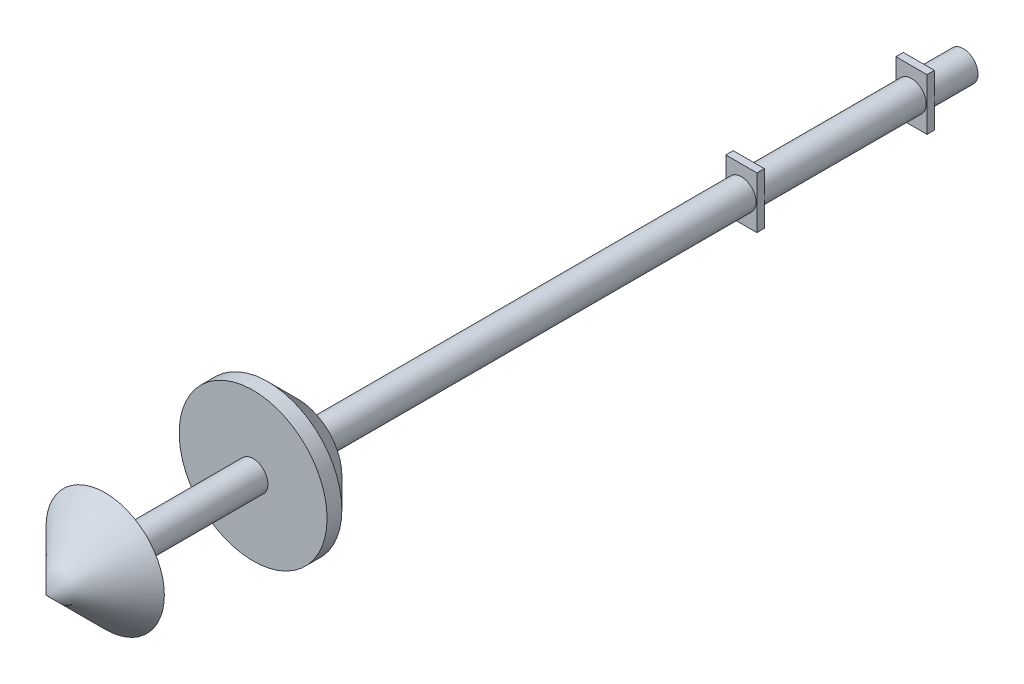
ISO-10303-21;
HEADER;
FILE_DESCRIPTION(('STEP AP214'),'2;1');
FILE_NAME('part.step','',(''),(''),'','','');
FILE_SCHEMA(('AUTOMOTIVE_DESIGN { 1 0 10303 214 1 1 1 1 }'));
ENDSEC;
DATA;
#1=APPLICATION_CONTEXT('core data for automotive mechanical design processes');
#2=APPLICATION_PROTOCOL_DEFINITION('international standard','automotive_design',2000,#1);
#3=PRODUCT_CONTEXT('',#1,'mechanical');
#4=PRODUCT('Part','Part','',(#3));
#5=PRODUCT_RELATED_PRODUCT_CATEGORY('part','',(#4));
#6=PRODUCT_DEFINITION_FORMATION('','',#4);
#7=PRODUCT_DEFINITION_CONTEXT('part definition',#1,'design');
#8=PRODUCT_DEFINITION('design','',#6,#7);
#9=PRODUCT_DEFINITION_SHAPE('','',#8);
#10=(LENGTH_UNIT() NAMED_UNIT(*) SI_UNIT(.MILLI.,.METRE.));
#11=(NAMED_UNIT(*) PLANE_ANGLE_UNIT() SI_UNIT($,.RADIAN.));
#12=(NAMED_UNIT(*) SI_UNIT($,.STERADIAN.) SOLID_ANGLE_UNIT());
#13=UNCERTAINTY_MEASURE_WITH_UNIT(LENGTH_MEASURE(1.E-05),#10,'distance_accuracy_value','');
#14=(GEOMETRIC_REPRESENTATION_CONTEXT(3) GLOBAL_UNCERTAINTY_ASSIGNED_CONTEXT((#13)) GLOBAL_UNIT_ASSIGNED_CONTEXT((#10,
#11,#12)) REPRESENTATION_CONTEXT('',''));
#15=CARTESIAN_POINT('',(0.,0.,0.));
#16=DIRECTION('',(0.,0.,1.));
#17=DIRECTION('',(1.,0.,0.));
#18=AXIS2_PLACEMENT_3D('',#15,#16,#17);
#19=CARTESIAN_POINT('',(0.,0.,330.));
#20=DIRECTION('',(0.,0.,1.));
#21=DIRECTION('',(1.,0.,0.));
#22=AXIS2_PLACEMENT_3D('',#19,#20,#21);
#23=PLANE('',#22);
#24=CARTESIAN_POINT('',(0.,0.,330.));
#25=DIRECTION('',(0.,0.,1.));
#26=DIRECTION('',(1.,0.,0.));
#27=AXIS2_PLACEMENT_3D('',#24,#25,#26);
#28=CIRCLE('',#27,50.);
#29=CARTESIAN_POINT('',(50.,0.,330.));
#30=VERTEX_POINT('',#29);
#31=EDGE_CURVE('E115',#30,#30,#28,.T.);
#32=ORIENTED_EDGE('',*,*,#31,.T.);
#33=EDGE_LOOP('',(#32));
#34=FACE_BOUND('',#33,.T.);
#35=CARTESIAN_POINT('',(0.,0.,330.));
#36=DIRECTION('',(0.,0.,1.));
#37=DIRECTION('',(1.,0.,0.));
#38=AXIS2_PLACEMENT_3D('',#35,#36,#37);
#39=CIRCLE('',#38,10.);
#40=CARTESIAN_POINT('',(10.,0.,330.));
#41=VERTEX_POINT('',#40);
#42=EDGE_CURVE('E107',#41,#41,#39,.T.);
#43=ORIENTED_EDGE('',*,*,#42,.F.);
#44=EDGE_LOOP('',(#43));
#45=FACE_BOUND('',#44,.T.);
#46=ADVANCED_FACE('F32',(#34,#45),#23,.T.);
#47=CARTESIAN_POINT('',(10.5,17.5,-120.));
#48=DIRECTION('',(0.,0.,-1.));
#49=DIRECTION('',(-1.,0.,0.));
#50=AXIS2_PLACEMENT_3D('',#47,#48,#49);
#51=PLANE('',#50);
#52=DIRECTION('',(1.,0.,0.));
#53=VECTOR('',#52,1.);
#54=CARTESIAN_POINT('',(-10.5,17.5,-120.));
#55=LINE('',#54,#53);
#56=CARTESIAN_POINT('',(-10.5,17.5,-120.));
#57=VERTEX_POINT('',#56);
#58=CARTESIAN_POINT('',(10.5,17.5,-120.));
#59=VERTEX_POINT('',#58);
#60=EDGE_CURVE('E133',#57,#59,#55,.T.);
#61=ORIENTED_EDGE('',*,*,#60,.T.);
#62=DIRECTION('',(0.,-1.,0.));
#63=VECTOR('',#62,1.);
#64=CARTESIAN_POINT('',(10.5,17.5,-120.));
#65=LINE('',#64,#63);
#66=CARTESIAN_POINT('',(10.5,-17.5,-120.));
#67=VERTEX_POINT('',#66);
#68=EDGE_CURVE('E136',#59,#67,#65,.T.);
#69=ORIENTED_EDGE('',*,*,#68,.T.);
#70=DIRECTION('',(-1.,0.,0.));
#71=VECTOR('',#70,1.);
#72=CARTESIAN_POINT('',(10.5,-17.5,-120.));
#73=LINE('',#72,#71);
#74=CARTESIAN_POINT('',(-10.5,-17.5,-120.));
#75=VERTEX_POINT('',#74);
#76=EDGE_CURVE('E138',#67,#75,#73,.T.);
#77=ORIENTED_EDGE('',*,*,#76,.T.);
#78=DIRECTION('',(0.,1.,0.));
#79=VECTOR('',#78,1.);
#80=CARTESIAN_POINT('',(-10.5,-17.5,-120.));
#81=LINE('',#80,#79);
#82=EDGE_CURVE('E140',#75,#57,#81,.T.);
#83=ORIENTED_EDGE('',*,*,#82,.T.);
#84=EDGE_LOOP('',(#61,#69,#77,#83));
#85=FACE_BOUND('',#84,.T.);
#86=CARTESIAN_POINT('',(0.,0.,-120.));
#87=DIRECTION('',(0.,0.,-1.));
#88=DIRECTION('',(-1.,0.,0.));
#89=AXIS2_PLACEMENT_3D('',#86,#87,#88);
#90=CIRCLE('',#89,10.);
#91=CARTESIAN_POINT('',(-10.,0.,-120.));
#92=VERTEX_POINT('',#91);
#93=EDGE_CURVE('E118',#92,#92,#90,.T.);
#94=ORIENTED_EDGE('',*,*,#93,.F.);
#95=EDGE_LOOP('',(#94));
#96=FACE_BOUND('',#95,.T.);
#97=ADVANCED_FACE('F214',(#85,#96),#51,.T.);
#98=CARTESIAN_POINT('',(10.5,-17.5,-5.));
#99=DIRECTION('',(0.,0.,-1.));
#100=DIRECTION('',(-1.,0.,0.));
#101=AXIS2_PLACEMENT_3D('',#98,#99,#100);
#102=PLANE('',#101);
#103=DIRECTION('',(0.,-1.,0.));
#104=VECTOR('',#103,1.);
#105=CARTESIAN_POINT('',(10.5,17.5,-5.));
#106=LINE('',#105,#104);
#107=CARTESIAN_POINT('',(10.5,17.5,-5.));
#108=VERTEX_POINT('',#107);
#109=CARTESIAN_POINT('',(10.5,-17.5,-5.));
#110=VERTEX_POINT('',#109);
#111=EDGE_CURVE('E169',#108,#110,#106,.T.);
#112=ORIENTED_EDGE('',*,*,#111,.T.);
#113=DIRECTION('',(-1.,0.,0.));
#114=VECTOR('',#113,1.);
#115=CARTESIAN_POINT('',(10.5,-17.5,-5.));
#116=LINE('',#115,#114);
#117=CARTESIAN_POINT('',(-10.5,-17.5,-5.));
#118=VERTEX_POINT('',#117);
#119=EDGE_CURVE('E171',#110,#118,#116,.T.);
#120=ORIENTED_EDGE('',*,*,#119,.T.);
#121=DIRECTION('',(0.,1.,0.));
#122=VECTOR('',#121,1.);
#123=CARTESIAN_POINT('',(-10.5,17.5,-5.));
#124=LINE('',#123,#122);
#125=CARTESIAN_POINT('',(-10.5,17.5,-5.));
#126=VERTEX_POINT('',#125);
#127=EDGE_CURVE('E52',#118,#126,#124,.T.);
#128=ORIENTED_EDGE('',*,*,#127,.T.);
#129=DIRECTION('',(1.,0.,0.));
#130=VECTOR('',#129,1.);
#131=CARTESIAN_POINT('',(10.5,17.5,-5.));
#132=LINE('',#131,#130);
#133=EDGE_CURVE('E47',#126,#108,#132,.T.);
#134=ORIENTED_EDGE('',*,*,#133,.T.);
#135=EDGE_LOOP('',(#112,#120,#128,#134));
#136=FACE_BOUND('',#135,.T.);
#137=CARTESIAN_POINT('',(0.,0.,-5.));
#138=DIRECTION('',(0.,0.,-1.));
#139=DIRECTION('',(-1.,0.,0.));
#140=AXIS2_PLACEMENT_3D('',#137,#138,#139);
#141=CIRCLE('',#140,10.);
#142=CARTESIAN_POINT('',(-10.,0.,-5.));
#143=VERTEX_POINT('',#142);
#144=EDGE_CURVE('E154',#143,#143,#141,.T.);
#145=ORIENTED_EDGE('',*,*,#144,.F.);
#146=EDGE_LOOP('',(#145));
#147=FACE_BOUND('',#146,.T.);
#148=ADVANCED_FACE('F220',(#136,#147),#102,.T.);
#149=CARTESIAN_POINT('',(0.,0.,300.));
#150=DIRECTION('',(0.,0.,-1.));
#151=DIRECTION('',(-1.,0.,0.));
#152=AXIS2_PLACEMENT_3D('',#149,#150,#151);
#153=CYLINDRICAL_SURFACE('',#152,10.);
#154=CARTESIAN_POINT('',(0.,0.,300.));
#155=DIRECTION('',(0.,0.,1.));
#156=DIRECTION('',(1.,0.,0.));
#157=AXIS2_PLACEMENT_3D('',#154,#155,#156);
#158=CIRCLE('',#157,10.);
#159=CARTESIAN_POINT('',(10.,0.,300.));
#160=VERTEX_POINT('',#159);
#161=EDGE_CURVE('E190',#160,#160,#158,.T.);
#162=ORIENTED_EDGE('',*,*,#161,.F.);
#163=EDGE_LOOP('',(#162));
#164=FACE_BOUND('',#163,.T.);
#165=CARTESIAN_POINT('',(0.,0.,0.));
#166=DIRECTION('',(0.,0.,-1.));
#167=DIRECTION('',(-1.,0.,0.));
#168=AXIS2_PLACEMENT_3D('',#165,#166,#167);
#169=CIRCLE('',#168,10.);
#170=CARTESIAN_POINT('',(-10.,0.,0.));
#171=VERTEX_POINT('',#170);
#172=EDGE_CURVE('E187',#171,#171,#169,.T.);
#173=ORIENTED_EDGE('',*,*,#172,.F.);
#174=EDGE_LOOP('',(#173));
#175=FACE_BOUND('',#174,.T.);
#176=ADVANCED_FACE('F34',(#164,#175),#153,.T.);
#177=CARTESIAN_POINT('',(10.5,-17.5,0.));
#178=DIRECTION('',(0.,0.,-1.));
#179=DIRECTION('',(-1.,0.,0.));
#180=AXIS2_PLACEMENT_3D('',#177,#178,#179);
#181=PLANE('',#180);
#182=DIRECTION('',(0.,-1.,0.));
#183=VECTOR('',#182,1.);
#184=CARTESIAN_POINT('',(10.5,17.5,0.));
#185=LINE('',#184,#183);
#186=CARTESIAN_POINT('',(10.5,17.5,0.));
#187=VERTEX_POINT('',#186);
#188=CARTESIAN_POINT('',(10.5,-17.5,0.));
#189=VERTEX_POINT('',#188);
#190=EDGE_CURVE('E160',#187,#189,#185,.T.);
#191=ORIENTED_EDGE('',*,*,#190,.F.);
#192=DIRECTION('',(1.,0.,0.));
#193=VECTOR('',#192,1.);
#194=CARTESIAN_POINT('',(10.5,17.5,0.));
#195=LINE('',#194,#193);
#196=CARTESIAN_POINT('',(-10.5,17.5,0.));
#197=VERTEX_POINT('',#196);
#198=EDGE_CURVE('E167',#197,#187,#195,.T.);
#199=ORIENTED_EDGE('',*,*,#198,.F.);
#200=DIRECTION('',(0.,1.,0.));
#201=VECTOR('',#200,1.);
#202=CARTESIAN_POINT('',(-10.5,17.5,0.));
#203=LINE('',#202,#201);
#204=CARTESIAN_POINT('',(-10.5,-17.5,0.));
#205=VERTEX_POINT('',#204);
#206=EDGE_CURVE('E165',#205,#197,#203,.T.);
#207=ORIENTED_EDGE('',*,*,#206,.F.);
#208=DIRECTION('',(-1.,0.,0.));
#209=VECTOR('',#208,1.);
#210=CARTESIAN_POINT('',(10.5,-17.5,0.));
#211=LINE('',#210,#209);
#212=EDGE_CURVE('E163',#189,#205,#211,.T.);
#213=ORIENTED_EDGE('',*,*,#212,.F.);
#214=EDGE_LOOP('',(#191,#199,#207,#213));
#215=FACE_BOUND('',#214,.T.);
#216=ORIENTED_EDGE('',*,*,#172,.T.);
#217=EDGE_LOOP('',(#216));
#218=FACE_BOUND('',#217,.T.);
#219=ADVANCED_FACE('F258',(#215,#218),#181,.F.);
#220=CARTESIAN_POINT('',(10.5,17.5,-5.));
#221=DIRECTION('',(-1.,0.,0.));
#222=DIRECTION('',(0.,-1.,0.));
#223=AXIS2_PLACEMENT_3D('',#220,#221,#222);
#224=PLANE('',#223);
#225=ORIENTED_EDGE('',*,*,#190,.T.);
#226=DIRECTION('',(0.,0.,1.));
#227=VECTOR('',#226,1.);
#228=CARTESIAN_POINT('',(10.5,-17.5,-5.));
#229=LINE('',#228,#227);
#230=EDGE_CURVE('E184',#110,#189,#229,.T.);
#231=ORIENTED_EDGE('',*,*,#230,.F.);
#232=ORIENTED_EDGE('',*,*,#111,.F.);
#233=DIRECTION('',(0.,0.,1.));
#234=VECTOR('',#233,1.);
#235=CARTESIAN_POINT('',(10.5,17.5,-5.));
#236=LINE('',#235,#234);
#237=EDGE_CURVE('E175',#108,#187,#236,.T.);
#238=ORIENTED_EDGE('',*,*,#237,.T.);
#239=EDGE_LOOP('',(#225,#231,#232,#238));
#240=FACE_BOUND('',#239,.T.);
#241=ADVANCED_FACE('F261',(#240),#224,.F.);
#242=CARTESIAN_POINT('',(10.5,-17.5,-5.));
#243=DIRECTION('',(0.,1.,0.));
#244=DIRECTION('',(-1.,0.,0.));
#245=AXIS2_PLACEMENT_3D('',#242,#243,#244);
#246=PLANE('',#245);
#247=ORIENTED_EDGE('',*,*,#212,.T.);
#248=DIRECTION('',(0.,0.,1.));
#249=VECTOR('',#248,1.);
#250=CARTESIAN_POINT('',(-10.5,-17.5,-5.));
#251=LINE('',#250,#249);
#252=EDGE_CURVE('E181',#118,#205,#251,.T.);
#253=ORIENTED_EDGE('',*,*,#252,.F.);
#254=ORIENTED_EDGE('',*,*,#119,.F.);
#255=ORIENTED_EDGE('',*,*,#230,.T.);
#256=EDGE_LOOP('',(#247,#253,#254,#255));
#257=FACE_BOUND('',#256,.T.);
#258=ADVANCED_FACE('F271',(#257),#246,.F.);
#259=CARTESIAN_POINT('',(-10.5,17.5,-5.));
#260=DIRECTION('',(1.,0.,0.));
#261=DIRECTION('',(0.,1.,0.));
#262=AXIS2_PLACEMENT_3D('',#259,#260,#261);
#263=PLANE('',#262);
#264=ORIENTED_EDGE('',*,*,#206,.T.);
#265=DIRECTION('',(0.,0.,1.));
#266=VECTOR('',#265,1.);
#267=CARTESIAN_POINT('',(-10.5,17.5,-5.));
#268=LINE('',#267,#266);
#269=EDGE_CURVE('E178',#126,#197,#268,.T.);
#270=ORIENTED_EDGE('',*,*,#269,.F.);
#271=ORIENTED_EDGE('',*,*,#127,.F.);
#272=ORIENTED_EDGE('',*,*,#252,.T.);
#273=EDGE_LOOP('',(#264,#270,#271,#272));
#274=FACE_BOUND('',#273,.T.);
#275=ADVANCED_FACE('F267',(#274),#263,.F.);
#276=CARTESIAN_POINT('',(10.5,17.5,-5.));
#277=DIRECTION('',(0.,-1.,0.));
#278=DIRECTION('',(1.,0.,0.));
#279=AXIS2_PLACEMENT_3D('',#276,#277,#278);
#280=PLANE('',#279);
#281=ORIENTED_EDGE('',*,*,#198,.T.);
#282=ORIENTED_EDGE('',*,*,#237,.F.);
#283=ORIENTED_EDGE('',*,*,#133,.F.);
#284=ORIENTED_EDGE('',*,*,#269,.T.);
#285=EDGE_LOOP('',(#281,#282,#283,#284));
#286=FACE_BOUND('',#285,.T.);
#287=ADVANCED_FACE('F256',(#286),#280,.F.);
#288=CARTESIAN_POINT('',(0.,0.,-115.));
#289=DIRECTION('',(0.,0.,1.));
#290=DIRECTION('',(1.,0.,0.));
#291=AXIS2_PLACEMENT_3D('',#288,#289,#290);
#292=CYLINDRICAL_SURFACE('',#291,10.);
#293=CARTESIAN_POINT('',(0.,0.,-115.));
#294=DIRECTION('',(0.,0.,-1.));
#295=DIRECTION('',(-1.,0.,0.));
#296=AXIS2_PLACEMENT_3D('',#293,#294,#295);
#297=CIRCLE('',#296,10.);
#298=CARTESIAN_POINT('',(-10.,0.,-115.));
#299=VERTEX_POINT('',#298);
#300=EDGE_CURVE('E157',#299,#299,#297,.T.);
#301=ORIENTED_EDGE('',*,*,#300,.F.);
#302=EDGE_LOOP('',(#301));
#303=FACE_BOUND('',#302,.T.);
#304=ORIENTED_EDGE('',*,*,#144,.T.);
#305=EDGE_LOOP('',(#304));
#306=FACE_BOUND('',#305,.T.);
#307=ADVANCED_FACE('F237',(#303,#306),#292,.T.);
#308=CARTESIAN_POINT('',(10.5,17.5,-115.));
#309=DIRECTION('',(0.,0.,-1.));
#310=DIRECTION('',(-1.,0.,0.));
#311=AXIS2_PLACEMENT_3D('',#308,#309,#310);
#312=PLANE('',#311);
#313=DIRECTION('',(1.,0.,0.));
#314=VECTOR('',#313,1.);
#315=CARTESIAN_POINT('',(-10.5,17.5,-115.));
#316=LINE('',#315,#314);
#317=CARTESIAN_POINT('',(-10.5,17.5,-115.));
#318=VERTEX_POINT('',#317);
#319=CARTESIAN_POINT('',(10.5,17.5,-115.));
#320=VERTEX_POINT('',#319);
#321=EDGE_CURVE('E124',#318,#320,#316,.T.);
#322=ORIENTED_EDGE('',*,*,#321,.F.);
#323=DIRECTION('',(0.,1.,0.));
#324=VECTOR('',#323,1.);
#325=CARTESIAN_POINT('',(-10.5,-17.5,-115.));
#326=LINE('',#325,#324);
#327=CARTESIAN_POINT('',(-10.5,-17.5,-115.));
#328=VERTEX_POINT('',#327);
#329=EDGE_CURVE('E131',#328,#318,#326,.T.);
#330=ORIENTED_EDGE('',*,*,#329,.F.);
#331=DIRECTION('',(-1.,0.,0.));
#332=VECTOR('',#331,1.);
#333=CARTESIAN_POINT('',(10.5,-17.5,-115.));
#334=LINE('',#333,#332);
#335=CARTESIAN_POINT('',(10.5,-17.5,-115.));
#336=VERTEX_POINT('',#335);
#337=EDGE_CURVE('E129',#336,#328,#334,.T.);
#338=ORIENTED_EDGE('',*,*,#337,.F.);
#339=DIRECTION('',(0.,-1.,0.));
#340=VECTOR('',#339,1.);
#341=CARTESIAN_POINT('',(10.5,17.5,-115.));
#342=LINE('',#341,#340);
#343=EDGE_CURVE('E127',#320,#336,#342,.T.);
#344=ORIENTED_EDGE('',*,*,#343,.F.);
#345=EDGE_LOOP('',(#322,#330,#338,#344));
#346=FACE_BOUND('',#345,.T.);
#347=ORIENTED_EDGE('',*,*,#300,.T.);
#348=EDGE_LOOP('',(#347));
#349=FACE_BOUND('',#348,.T.);
#350=ADVANCED_FACE('F234',(#346,#349),#312,.F.);
#351=CARTESIAN_POINT('',(-10.5,17.5,-120.));
#352=DIRECTION('',(0.,-1.,0.));
#353=DIRECTION('',(1.,0.,0.));
#354=AXIS2_PLACEMENT_3D('',#351,#352,#353);
#355=PLANE('',#354);
#356=ORIENTED_EDGE('',*,*,#321,.T.);
#357=DIRECTION('',(0.,0.,1.));
#358=VECTOR('',#357,1.);
#359=CARTESIAN_POINT('',(10.5,17.5,-120.));
#360=LINE('',#359,#358);
#361=EDGE_CURVE('E151',#59,#320,#360,.T.);
#362=ORIENTED_EDGE('',*,*,#361,.F.);
#363=ORIENTED_EDGE('',*,*,#60,.F.);
#364=DIRECTION('',(0.,0.,1.));
#365=VECTOR('',#364,1.);
#366=CARTESIAN_POINT('',(-10.5,17.5,-120.));
#367=LINE('',#366,#365);
#368=EDGE_CURVE('E142',#57,#318,#367,.T.);
#369=ORIENTED_EDGE('',*,*,#368,.T.);
#370=EDGE_LOOP('',(#356,#362,#363,#369));
#371=FACE_BOUND('',#370,.T.);
#372=ADVANCED_FACE('F236',(#371),#355,.F.);
#373=CARTESIAN_POINT('',(10.5,17.5,-120.));
#374=DIRECTION('',(-1.,0.,0.));
#375=DIRECTION('',(0.,-1.,0.));
#376=AXIS2_PLACEMENT_3D('',#373,#374,#375);
#377=PLANE('',#376);
#378=ORIENTED_EDGE('',*,*,#343,.T.);
#379=DIRECTION('',(0.,0.,1.));
#380=VECTOR('',#379,1.);
#381=CARTESIAN_POINT('',(10.5,-17.5,-120.));
#382=LINE('',#381,#380);
#383=EDGE_CURVE('E148',#67,#336,#382,.T.);
#384=ORIENTED_EDGE('',*,*,#383,.F.);
#385=ORIENTED_EDGE('',*,*,#68,.F.);
#386=ORIENTED_EDGE('',*,*,#361,.T.);
#387=EDGE_LOOP('',(#378,#384,#385,#386));
#388=FACE_BOUND('',#387,.T.);
#389=ADVANCED_FACE('F246',(#388),#377,.F.);
#390=CARTESIAN_POINT('',(10.5,-17.5,-120.));
#391=DIRECTION('',(0.,1.,0.));
#392=DIRECTION('',(-1.,0.,0.));
#393=AXIS2_PLACEMENT_3D('',#390,#391,#392);
#394=PLANE('',#393);
#395=ORIENTED_EDGE('',*,*,#337,.T.);
#396=DIRECTION('',(0.,0.,1.));
#397=VECTOR('',#396,1.);
#398=CARTESIAN_POINT('',(-10.5,-17.5,-120.));
#399=LINE('',#398,#397);
#400=EDGE_CURVE('E145',#75,#328,#399,.T.);
#401=ORIENTED_EDGE('',*,*,#400,.F.);
#402=ORIENTED_EDGE('',*,*,#76,.F.);
#403=ORIENTED_EDGE('',*,*,#383,.T.);
#404=EDGE_LOOP('',(#395,#401,#402,#403));
#405=FACE_BOUND('',#404,.T.);
#406=ADVANCED_FACE('F242',(#405),#394,.F.);
#407=CARTESIAN_POINT('',(-10.5,-17.5,-120.));
#408=DIRECTION('',(1.,0.,0.));
#409=DIRECTION('',(0.,1.,0.));
#410=AXIS2_PLACEMENT_3D('',#407,#408,#409);
#411=PLANE('',#410);
#412=ORIENTED_EDGE('',*,*,#329,.T.);
#413=ORIENTED_EDGE('',*,*,#368,.F.);
#414=ORIENTED_EDGE('',*,*,#82,.F.);
#415=ORIENTED_EDGE('',*,*,#400,.T.);
#416=EDGE_LOOP('',(#412,#413,#414,#415));
#417=FACE_BOUND('',#416,.T.);
#418=ADVANCED_FACE('F232',(#417),#411,.F.);
#419=CARTESIAN_POINT('',(0.,0.,-150.));
#420=DIRECTION('',(0.,0.,1.));
#421=DIRECTION('',(1.,0.,0.));
#422=AXIS2_PLACEMENT_3D('',#419,#420,#421);
#423=CYLINDRICAL_SURFACE('',#422,10.);
#424=CARTESIAN_POINT('',(0.,0.,-150.));
#425=DIRECTION('',(0.,0.,-1.));
#426=DIRECTION('',(-1.,0.,0.));
#427=AXIS2_PLACEMENT_3D('',#424,#425,#426);
#428=CIRCLE('',#427,10.);
#429=CARTESIAN_POINT('',(-10.,0.,-150.));
#430=VERTEX_POINT('',#429);
#431=EDGE_CURVE('E121',#430,#430,#428,.T.);
#432=ORIENTED_EDGE('',*,*,#431,.F.);
#433=EDGE_LOOP('',(#432));
#434=FACE_BOUND('',#433,.T.);
#435=ORIENTED_EDGE('',*,*,#93,.T.);
#436=EDGE_LOOP('',(#435));
#437=FACE_BOUND('',#436,.T.);
#438=ADVANCED_FACE('F228',(#434,#437),#423,.T.);
#439=CARTESIAN_POINT('',(0.,0.,-150.));
#440=DIRECTION('',(0.,0.,-1.));
#441=DIRECTION('',(-1.,0.,0.));
#442=AXIS2_PLACEMENT_3D('',#439,#440,#441);
#443=PLANE('',#442);
#444=ORIENTED_EDGE('',*,*,#431,.T.);
#445=EDGE_LOOP('',(#444));
#446=FACE_BOUND('',#445,.T.);
#447=ADVANCED_FACE('F225',(#446),#443,.T.);
#448=CARTESIAN_POINT('',(0.,0.,300.));
#449=DIRECTION('',(0.,0.,1.));
#450=DIRECTION('',(1.,0.,0.));
#451=AXIS2_PLACEMENT_3D('',#448,#449,#450);
#452=PLANE('',#451);
#453=CARTESIAN_POINT('',(0.,0.,300.));
#454=DIRECTION('',(0.,0.,1.));
#455=DIRECTION('',(1.,0.,0.));
#456=AXIS2_PLACEMENT_3D('',#453,#454,#455);
#457=CIRCLE('',#456,30.);
#458=CARTESIAN_POINT('',(30.,0.,300.));
#459=VERTEX_POINT('',#458);
#460=EDGE_CURVE('E11',#459,#459,#457,.F.);
#461=ORIENTED_EDGE('',*,*,#460,.T.);
#462=EDGE_LOOP('',(#461));
#463=FACE_BOUND('',#462,.T.);
#464=ORIENTED_EDGE('',*,*,#161,.T.);
#465=EDGE_LOOP('',(#464));
#466=FACE_BOUND('',#465,.T.);
#467=ADVANCED_FACE('F209',(#463,#466),#452,.F.);
#468=CARTESIAN_POINT('',(0.,0.,330.));
#469=DIRECTION('',(0.,0.,-1.));
#470=DIRECTION('',(-1.,0.,0.));
#471=AXIS2_PLACEMENT_3D('',#468,#469,#470);
#472=CYLINDRICAL_SURFACE('',#471,50.);
#473=CARTESIAN_POINT('',(0.,0.,320.));
#474=DIRECTION('',(0.,0.,1.));
#475=DIRECTION('',(1.,0.,0.));
#476=AXIS2_PLACEMENT_3D('',#473,#474,#475);
#477=CIRCLE('',#476,50.);
#478=CARTESIAN_POINT('',(50.,0.,320.));
#479=VERTEX_POINT('',#478);
#480=EDGE_CURVE('E40',#479,#479,#477,.T.);
#481=ORIENTED_EDGE('',*,*,#480,.T.);
#482=EDGE_LOOP('',(#481));
#483=FACE_BOUND('',#482,.T.);
#484=ORIENTED_EDGE('',*,*,#31,.F.);
#485=EDGE_LOOP('',(#484));
#486=FACE_BOUND('',#485,.T.);
#487=ADVANCED_FACE('F195',(#483,#486),#472,.T.);
#488=CARTESIAN_POINT('',(0.,0.,320.));
#489=DIRECTION('',(0.,0.,1.));
#490=DIRECTION('',(1.,0.,0.));
#491=AXIS2_PLACEMENT_3D('',#488,#489,#490);
#492=CONICAL_SURFACE('',#491,50.,0.78539816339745);
#493=ORIENTED_EDGE('',*,*,#460,.F.);
#494=EDGE_LOOP('',(#493));
#495=FACE_BOUND('',#494,.T.);
#496=ORIENTED_EDGE('',*,*,#480,.F.);
#497=EDGE_LOOP('',(#496));
#498=FACE_BOUND('',#497,.T.);
#499=ADVANCED_FACE('F198',(#495,#498),#492,.T.);
#500=CARTESIAN_POINT('',(0.,0.,430.));
#501=DIRECTION('',(0.,0.,-1.));
#502=DIRECTION('',(-1.,0.,0.));
#503=AXIS2_PLACEMENT_3D('',#500,#501,#502);
#504=CYLINDRICAL_SURFACE('',#503,10.);
#505=CARTESIAN_POINT('',(0.,0.,430.));
#506=DIRECTION('',(0.,0.,1.));
#507=DIRECTION('',(1.,0.,0.));
#508=AXIS2_PLACEMENT_3D('',#505,#506,#507);
#509=CIRCLE('',#508,10.);
#510=CARTESIAN_POINT('',(10.,0.,430.));
#511=VERTEX_POINT('',#510);
#512=EDGE_CURVE('E110',#511,#511,#509,.T.);
#513=ORIENTED_EDGE('',*,*,#512,.F.);
#514=EDGE_LOOP('',(#513));
#515=FACE_BOUND('',#514,.T.);
#516=ORIENTED_EDGE('',*,*,#42,.T.);
#517=EDGE_LOOP('',(#516));
#518=FACE_BOUND('',#517,.T.);
#519=ADVANCED_FACE('F200',(#515,#518),#504,.T.);
#520=CARTESIAN_POINT('',(0.,0.,430.));
#521=DIRECTION('',(0.,0.,1.));
#522=DIRECTION('',(1.,0.,0.));
#523=AXIS2_PLACEMENT_3D('',#520,#521,#522);
#524=PLANE('',#523);
#525=CARTESIAN_POINT('',(0.,0.,430.));
#526=DIRECTION('',(0.,0.,1.));
#527=DIRECTION('',(1.,0.,0.));
#528=AXIS2_PLACEMENT_3D('',#525,#526,#527);
#529=CIRCLE('',#528,40.);
#530=CARTESIAN_POINT('',(40.,0.,430.));
#531=VERTEX_POINT('',#530);
#532=EDGE_CURVE('E105',#531,#531,#529,.T.);
#533=ORIENTED_EDGE('',*,*,#532,.F.);
#534=EDGE_LOOP('',(#533));
#535=FACE_BOUND('',#534,.T.);
#536=ORIENTED_EDGE('',*,*,#512,.T.);
#537=EDGE_LOOP('',(#536));
#538=FACE_BOUND('',#537,.T.);
#539=ADVANCED_FACE('F101',(#535,#538),#524,.F.);
#540=CARTESIAN_POINT('',(0.,0.,430.));
#541=DIRECTION('',(0.,0.,-1.));
#542=DIRECTION('',(-1.,0.,0.));
#543=AXIS2_PLACEMENT_3D('',#540,#541,#542);
#544=CONICAL_SURFACE('',#543,40.,0.785398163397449);
#545=CARTESIAN_POINT('',(0.,0.,470.));
#546=VERTEX_POINT('',#545);
#547=VERTEX_LOOP('',#546);
#548=FACE_BOUND('',#547,.T.);
#549=ORIENTED_EDGE('',*,*,#532,.T.);
#550=EDGE_LOOP('',(#549));
#551=FACE_BOUND('',#550,.T.);
#552=ADVANCED_FACE('F98',(#548,#551),#544,.T.);
#553=CLOSED_SHELL('',(#46,#97,#148,#176,#219,#241,#258,#275,#287,#307,#350,#372,#389,#406,#418,
#438,#447,#467,#487,#499,#519,#539,#552));
#554=MANIFOLD_SOLID_BREP('B2',#553);
#555=ADVANCED_BREP_SHAPE_REPRESENTATION('',(#18,#554),#14);
#556=SHAPE_DEFINITION_REPRESENTATION(#9,#555);
ENDSEC;
END-ISO-10303-21;
